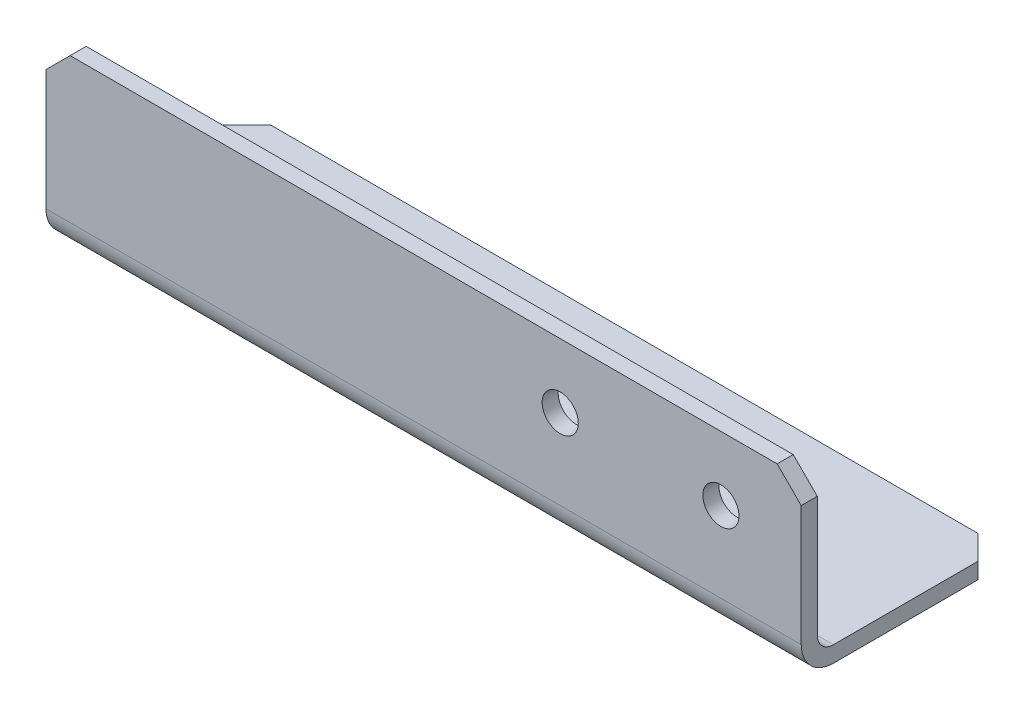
ISO-10303-21;
HEADER;
FILE_DESCRIPTION(('STEP AP214'),'2;1');
FILE_NAME('part.step','',(''),(''),'','','');
FILE_SCHEMA(('AUTOMOTIVE_DESIGN { 1 0 10303 214 1 1 1 1 }'));
ENDSEC;
DATA;
#1=APPLICATION_CONTEXT('core data for automotive mechanical design processes');
#2=APPLICATION_PROTOCOL_DEFINITION('international standard','automotive_design',2000,#1);
#3=PRODUCT_CONTEXT('',#1,'mechanical');
#4=PRODUCT('Part','Part','',(#3));
#5=PRODUCT_RELATED_PRODUCT_CATEGORY('part','',(#4));
#6=PRODUCT_DEFINITION_FORMATION('','',#4);
#7=PRODUCT_DEFINITION_CONTEXT('part definition',#1,'design');
#8=PRODUCT_DEFINITION('design','',#6,#7);
#9=PRODUCT_DEFINITION_SHAPE('','',#8);
#10=(LENGTH_UNIT() NAMED_UNIT(*) SI_UNIT(.MILLI.,.METRE.));
#11=(NAMED_UNIT(*) PLANE_ANGLE_UNIT() SI_UNIT($,.RADIAN.));
#12=(NAMED_UNIT(*) SI_UNIT($,.STERADIAN.) SOLID_ANGLE_UNIT());
#13=UNCERTAINTY_MEASURE_WITH_UNIT(LENGTH_MEASURE(1.E-05),#10,'distance_accuracy_value','');
#14=(GEOMETRIC_REPRESENTATION_CONTEXT(3) GLOBAL_UNCERTAINTY_ASSIGNED_CONTEXT((#13)) GLOBAL_UNIT_ASSIGNED_CONTEXT((#10,
#11,#12)) REPRESENTATION_CONTEXT('',''));
#15=CARTESIAN_POINT('',(0.,0.,0.));
#16=DIRECTION('',(0.,0.,1.));
#17=DIRECTION('',(1.,0.,0.));
#18=AXIS2_PLACEMENT_3D('',#15,#16,#17);
#19=CARTESIAN_POINT('',(93.9999999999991,-1.11022302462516E-13,-24.9999999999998));
#20=DIRECTION('',(0.,0.,1.));
#21=DIRECTION('',(1.,0.,0.));
#22=AXIS2_PLACEMENT_3D('',#19,#20,#21);
#23=PLANE('',#22);
#24=DIRECTION('',(-1.,0.,0.));
#25=VECTOR('',#24,1.);
#26=CARTESIAN_POINT('',(93.9999999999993,2.,-24.9999999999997));
#27=LINE('',#26,#25);
#28=CARTESIAN_POINT('',(90.999999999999,1.99999999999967,-25.));
#29=VERTEX_POINT('',#28);
#30=CARTESIAN_POINT('',(2.99999999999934,2.00000000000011,-25.));
#31=VERTEX_POINT('',#30);
#32=EDGE_CURVE('E145',#29,#31,#27,.T.);
#33=ORIENTED_EDGE('',*,*,#32,.F.);
#34=DIRECTION('',(0.,-1.,0.));
#35=VECTOR('',#34,1.);
#36=CARTESIAN_POINT('',(90.9999999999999,3.33066907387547E-13,-24.9999999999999));
#37=LINE('',#36,#35);
#38=CARTESIAN_POINT('',(90.9999999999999,3.33066907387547E-13,-24.9999999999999));
#39=VERTEX_POINT('',#38);
#40=EDGE_CURVE('E208',#29,#39,#37,.T.);
#41=ORIENTED_EDGE('',*,*,#40,.T.);
#42=DIRECTION('',(-1.,0.,0.));
#43=VECTOR('',#42,1.);
#44=CARTESIAN_POINT('',(93.9999999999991,-1.11022302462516E-13,-24.9999999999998));
#45=LINE('',#44,#43);
#46=CARTESIAN_POINT('',(2.99999999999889,-3.33066907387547E-13,-24.9999999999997));
#47=VERTEX_POINT('',#46);
#48=EDGE_CURVE('E162',#39,#47,#45,.T.);
#49=ORIENTED_EDGE('',*,*,#48,.T.);
#50=DIRECTION('',(0.,1.,0.));
#51=VECTOR('',#50,1.);
#52=CARTESIAN_POINT('',(2.99999999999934,2.00000000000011,-25.));
#53=LINE('',#52,#51);
#54=EDGE_CURVE('E205',#47,#31,#53,.T.);
#55=ORIENTED_EDGE('',*,*,#54,.T.);
#56=EDGE_LOOP('',(#33,#41,#49,#55));
#57=FACE_BOUND('',#56,.T.);
#58=ADVANCED_FACE('F36',(#57),#23,.F.);
#59=CARTESIAN_POINT('',(93.9999999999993,2.,-24.9999999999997));
#60=DIRECTION('',(0.,-1.,0.));
#61=DIRECTION('',(0.,0.,-1.));
#62=AXIS2_PLACEMENT_3D('',#59,#60,#61);
#63=PLANE('',#62);
#64=DIRECTION('',(0.,0.,1.));
#65=VECTOR('',#64,1.);
#66=CARTESIAN_POINT('',(93.9999999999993,2.,-24.9999999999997));
#67=LINE('',#66,#65);
#68=CARTESIAN_POINT('',(93.9999999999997,2.,-21.9999999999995));
#69=VERTEX_POINT('',#68);
#70=CARTESIAN_POINT('',(93.9999999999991,2.00000000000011,-3.99999999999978));
#71=VERTEX_POINT('',#70);
#72=EDGE_CURVE('E125',#69,#71,#67,.T.);
#73=ORIENTED_EDGE('',*,*,#72,.F.);
#74=DIRECTION('',(0.70710678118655,0.,0.707106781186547));
#75=VECTOR('',#74,1.);
#76=CARTESIAN_POINT('',(93.9999999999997,2.,-21.9999999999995));
#77=LINE('',#76,#75);
#78=EDGE_CURVE('E203',#69,#29,#77,.F.);
#79=ORIENTED_EDGE('',*,*,#78,.T.);
#80=ORIENTED_EDGE('',*,*,#32,.T.);
#81=DIRECTION('',(-0.707106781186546,0.,0.707106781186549));
#82=VECTOR('',#81,1.);
#83=CARTESIAN_POINT('',(2.99999999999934,2.00000000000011,-25.));
#84=LINE('',#83,#82);
#85=CARTESIAN_POINT('',(-9.99200722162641E-13,1.99999999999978,-21.9999999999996));
#86=VERTEX_POINT('',#85);
#87=EDGE_CURVE('E201',#31,#86,#84,.T.);
#88=ORIENTED_EDGE('',*,*,#87,.T.);
#89=DIRECTION('',(0.,0.,1.));
#90=VECTOR('',#89,1.);
#91=CARTESIAN_POINT('',(-1.22124532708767E-12,1.99999999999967,-25.));
#92=LINE('',#91,#90);
#93=CARTESIAN_POINT('',(1.11022302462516E-13,2.00000000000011,-4.00000000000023));
#94=VERTEX_POINT('',#93);
#95=EDGE_CURVE('E142',#86,#94,#92,.T.);
#96=ORIENTED_EDGE('',*,*,#95,.T.);
#97=DIRECTION('',(-1.,0.,0.));
#98=VECTOR('',#97,1.);
#99=CARTESIAN_POINT('',(93.9999999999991,2.00000000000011,-3.99999999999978));
#100=LINE('',#99,#98);
#101=EDGE_CURVE('E139',#71,#94,#100,.T.);
#102=ORIENTED_EDGE('',*,*,#101,.F.);
#103=EDGE_LOOP('',(#73,#79,#80,#88,#96,#102));
#104=FACE_BOUND('',#103,.T.);
#105=ADVANCED_FACE('F140',(#104),#63,.F.);
#106=CARTESIAN_POINT('',(93.9999999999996,4.00000000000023,-3.99999999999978));
#107=DIRECTION('',(-1.,0.,0.));
#108=DIRECTION('',(0.,0.,1.));
#109=AXIS2_PLACEMENT_3D('',#106,#107,#108);
#110=CYLINDRICAL_SURFACE('',#109,2.);
#111=CARTESIAN_POINT('',(-1.33226762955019E-12,3.99999999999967,-3.99999999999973));
#112=DIRECTION('',(-1.,0.,0.));
#113=DIRECTION('',(0.,0.,1.));
#114=AXIS2_PLACEMENT_3D('',#111,#112,#113);
#115=CIRCLE('',#114,2.);
#116=CARTESIAN_POINT('',(-9.99200722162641E-13,4.00000000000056,-1.99999999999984));
#117=VERTEX_POINT('',#116);
#118=EDGE_CURVE('E164',#94,#117,#115,.T.);
#119=ORIENTED_EDGE('',*,*,#118,.T.);
#120=DIRECTION('',(-1.,0.,0.));
#121=VECTOR('',#120,1.);
#122=CARTESIAN_POINT('',(93.9999999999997,4.00000000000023,-2.));
#123=LINE('',#122,#121);
#124=CARTESIAN_POINT('',(93.9999999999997,4.00000000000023,-2.));
#125=VERTEX_POINT('',#124);
#126=EDGE_CURVE('E146',#125,#117,#123,.T.);
#127=ORIENTED_EDGE('',*,*,#126,.F.);
#128=CARTESIAN_POINT('',(93.9999999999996,4.00000000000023,-3.99999999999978));
#129=DIRECTION('',(-1.,0.,0.));
#130=DIRECTION('',(0.,0.,1.));
#131=AXIS2_PLACEMENT_3D('',#128,#129,#130);
#132=CIRCLE('',#131,2.);
#133=EDGE_CURVE('E131',#71,#125,#132,.T.);
#134=ORIENTED_EDGE('',*,*,#133,.F.);
#135=ORIENTED_EDGE('',*,*,#101,.T.);
#136=EDGE_LOOP('',(#119,#127,#134,#135));
#137=FACE_BOUND('',#136,.T.);
#138=ADVANCED_FACE('F148',(#137),#110,.F.);
#139=CARTESIAN_POINT('',(93.9999999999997,4.00000000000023,-2.));
#140=DIRECTION('',(0.,0.,1.));
#141=DIRECTION('',(0.,-1.,0.));
#142=AXIS2_PLACEMENT_3D('',#139,#140,#141);
#143=PLANE('',#142);
#144=CARTESIAN_POINT('',(83.9999999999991,14.0000000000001,-1.99999999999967));
#145=DIRECTION('',(0.,0.,-1.));
#146=DIRECTION('',(0.,1.,0.));
#147=AXIS2_PLACEMENT_3D('',#144,#145,#146);
#148=CIRCLE('',#147,2.25);
#149=CARTESIAN_POINT('',(83.9999999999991,16.2500000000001,-1.99999999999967));
#150=VERTEX_POINT('',#149);
#151=EDGE_CURVE('E195',#150,#150,#148,.T.);
#152=ORIENTED_EDGE('',*,*,#151,.F.);
#153=EDGE_LOOP('',(#152));
#154=FACE_BOUND('',#153,.T.);
#155=CARTESIAN_POINT('',(63.9999999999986,14.,-1.99999999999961));
#156=DIRECTION('',(0.,0.,-1.));
#157=DIRECTION('',(0.,1.,0.));
#158=AXIS2_PLACEMENT_3D('',#155,#156,#157);
#159=CIRCLE('',#158,2.25);
#160=CARTESIAN_POINT('',(63.9999999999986,16.25,-1.99999999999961));
#161=VERTEX_POINT('',#160);
#162=EDGE_CURVE('E366',#161,#161,#159,.T.);
#163=ORIENTED_EDGE('',*,*,#162,.F.);
#164=EDGE_LOOP('',(#163));
#165=FACE_BOUND('',#164,.T.);
#166=DIRECTION('',(-1.,0.,0.));
#167=VECTOR('',#166,1.);
#168=CARTESIAN_POINT('',(93.9999999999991,21.9999999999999,-1.99999999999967));
#169=LINE('',#168,#167);
#170=CARTESIAN_POINT('',(90.9999999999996,22.0000000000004,-1.99999999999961));
#171=VERTEX_POINT('',#170);
#172=CARTESIAN_POINT('',(2.99999999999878,22.,-1.99999999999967));
#173=VERTEX_POINT('',#172);
#174=EDGE_CURVE('E186',#171,#173,#169,.T.);
#175=ORIENTED_EDGE('',*,*,#174,.F.);
#176=DIRECTION('',(-0.70710678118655,0.707106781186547,0.));
#177=VECTOR('',#176,1.);
#178=CARTESIAN_POINT('',(94.,19.0000000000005,-2.));
#179=LINE('',#178,#177);
#180=CARTESIAN_POINT('',(94.,19.0000000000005,-2.));
#181=VERTEX_POINT('',#180);
#182=EDGE_CURVE('E11',#171,#181,#179,.F.);
#183=ORIENTED_EDGE('',*,*,#182,.T.);
#184=DIRECTION('',(0.,1.,0.));
#185=VECTOR('',#184,1.);
#186=CARTESIAN_POINT('',(93.9999999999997,4.00000000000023,-2.));
#187=LINE('',#186,#185);
#188=EDGE_CURVE('E151',#125,#181,#187,.T.);
#189=ORIENTED_EDGE('',*,*,#188,.F.);
#190=ORIENTED_EDGE('',*,*,#126,.T.);
#191=DIRECTION('',(0.,1.,0.));
#192=VECTOR('',#191,1.);
#193=CARTESIAN_POINT('',(-9.99200722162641E-13,4.00000000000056,-1.99999999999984));
#194=LINE('',#193,#192);
#195=CARTESIAN_POINT('',(-8.88178419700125E-13,18.9999999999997,-1.99999999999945));
#196=VERTEX_POINT('',#195);
#197=EDGE_CURVE('E167',#117,#196,#194,.T.);
#198=ORIENTED_EDGE('',*,*,#197,.T.);
#199=DIRECTION('',(0.707106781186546,0.70710678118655,0.));
#200=VECTOR('',#199,1.);
#201=CARTESIAN_POINT('',(2.99999999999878,22.,-1.99999999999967));
#202=LINE('',#201,#200);
#203=EDGE_CURVE('E44',#196,#173,#202,.T.);
#204=ORIENTED_EDGE('',*,*,#203,.T.);
#205=EDGE_LOOP('',(#175,#183,#189,#190,#198,#204));
#206=FACE_BOUND('',#205,.T.);
#207=ADVANCED_FACE('F237',(#154,#165,#206),#143,.F.);
#208=CARTESIAN_POINT('',(93.9999999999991,21.9999999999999,-1.99999999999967));
#209=DIRECTION('',(0.,-1.,0.));
#210=DIRECTION('',(0.,0.,-1.));
#211=AXIS2_PLACEMENT_3D('',#208,#209,#210);
#212=PLANE('',#211);
#213=DIRECTION('',(-1.,0.,0.));
#214=VECTOR('',#213,1.);
#215=CARTESIAN_POINT('',(93.999999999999,21.9999999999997,0.));
#216=LINE('',#215,#214);
#217=CARTESIAN_POINT('',(90.9999999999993,22.0000000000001,1.66533453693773E-13));
#218=VERTEX_POINT('',#217);
#219=CARTESIAN_POINT('',(2.99999999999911,22.,3.33066907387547E-13));
#220=VERTEX_POINT('',#219);
#221=EDGE_CURVE('E183',#218,#220,#216,.T.);
#222=ORIENTED_EDGE('',*,*,#221,.F.);
#223=DIRECTION('',(0.,0.,-1.));
#224=VECTOR('',#223,1.);
#225=CARTESIAN_POINT('',(90.9999999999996,22.0000000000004,-1.99999999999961));
#226=LINE('',#225,#224);
#227=EDGE_CURVE('E57',#218,#171,#226,.T.);
#228=ORIENTED_EDGE('',*,*,#227,.T.);
#229=ORIENTED_EDGE('',*,*,#174,.T.);
#230=DIRECTION('',(0.,0.,1.));
#231=VECTOR('',#230,1.);
#232=CARTESIAN_POINT('',(2.99999999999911,22.,3.33066907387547E-13));
#233=LINE('',#232,#231);
#234=EDGE_CURVE('E222',#173,#220,#233,.T.);
#235=ORIENTED_EDGE('',*,*,#234,.T.);
#236=EDGE_LOOP('',(#222,#228,#229,#235));
#237=FACE_BOUND('',#236,.T.);
#238=ADVANCED_FACE('F226',(#237),#212,.F.);
#239=CARTESIAN_POINT('',(93.999999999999,21.9999999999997,0.));
#240=DIRECTION('',(0.,0.,-1.));
#241=DIRECTION('',(0.,1.,0.));
#242=AXIS2_PLACEMENT_3D('',#239,#240,#241);
#243=PLANE('',#242);
#244=CARTESIAN_POINT('',(83.9999999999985,13.9999999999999,4.44089209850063E-13));
#245=DIRECTION('',(0.,0.,-1.));
#246=DIRECTION('',(0.,1.,0.));
#247=AXIS2_PLACEMENT_3D('',#244,#245,#246);
#248=CIRCLE('',#247,2.25);
#249=CARTESIAN_POINT('',(83.9999999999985,16.2499999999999,4.44713710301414E-13));
#250=VERTEX_POINT('',#249);
#251=EDGE_CURVE('E165',#250,#250,#248,.T.);
#252=ORIENTED_EDGE('',*,*,#251,.T.);
#253=EDGE_LOOP('',(#252));
#254=FACE_BOUND('',#253,.T.);
#255=CARTESIAN_POINT('',(63.9999999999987,13.9999999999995,1.11022302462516E-13));
#256=DIRECTION('',(0.,0.,-1.));
#257=DIRECTION('',(0.,1.,0.));
#258=AXIS2_PLACEMENT_3D('',#255,#256,#257);
#259=CIRCLE('',#258,2.25);
#260=CARTESIAN_POINT('',(63.9999999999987,16.2499999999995,1.11646802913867E-13));
#261=VERTEX_POINT('',#260);
#262=EDGE_CURVE('E192',#261,#261,#259,.T.);
#263=ORIENTED_EDGE('',*,*,#262,.T.);
#264=EDGE_LOOP('',(#263));
#265=FACE_BOUND('',#264,.T.);
#266=DIRECTION('',(0.,-1.,0.));
#267=VECTOR('',#266,1.);
#268=CARTESIAN_POINT('',(93.999999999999,21.9999999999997,0.));
#269=LINE('',#268,#267);
#270=CARTESIAN_POINT('',(93.9999999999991,19.,2.22044604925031E-13));
#271=VERTEX_POINT('',#270);
#272=CARTESIAN_POINT('',(94.0000000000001,4.00000000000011,0.));
#273=VERTEX_POINT('',#272);
#274=EDGE_CURVE('E153',#271,#273,#269,.T.);
#275=ORIENTED_EDGE('',*,*,#274,.F.);
#276=DIRECTION('',(0.70710678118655,-0.707106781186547,0.));
#277=VECTOR('',#276,1.);
#278=CARTESIAN_POINT('',(93.9999999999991,19.,2.22044604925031E-13));
#279=LINE('',#278,#277);
#280=EDGE_CURVE('E220',#271,#218,#279,.F.);
#281=ORIENTED_EDGE('',*,*,#280,.T.);
#282=ORIENTED_EDGE('',*,*,#221,.T.);
#283=DIRECTION('',(-0.707106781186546,-0.70710678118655,0.));
#284=VECTOR('',#283,1.);
#285=CARTESIAN_POINT('',(2.99999999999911,22.,3.33066907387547E-13));
#286=LINE('',#285,#284);
#287=CARTESIAN_POINT('',(-7.7715611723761E-13,18.9999999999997,4.44089209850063E-13));
#288=VERTEX_POINT('',#287);
#289=EDGE_CURVE('E218',#220,#288,#286,.T.);
#290=ORIENTED_EDGE('',*,*,#289,.T.);
#291=DIRECTION('',(0.,-1.,0.));
#292=VECTOR('',#291,1.);
#293=CARTESIAN_POINT('',(-1.11022302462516E-13,22.0000000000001,2.77555756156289E-13));
#294=LINE('',#293,#292);
#295=CARTESIAN_POINT('',(-5.55111512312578E-13,3.99999999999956,0.));
#296=VERTEX_POINT('',#295);
#297=EDGE_CURVE('E169',#288,#296,#294,.T.);
#298=ORIENTED_EDGE('',*,*,#297,.T.);
#299=DIRECTION('',(-1.,0.,0.));
#300=VECTOR('',#299,1.);
#301=CARTESIAN_POINT('',(94.0000000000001,4.00000000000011,0.));
#302=LINE('',#301,#300);
#303=EDGE_CURVE('E180',#273,#296,#302,.T.);
#304=ORIENTED_EDGE('',*,*,#303,.F.);
#305=EDGE_LOOP('',(#275,#281,#282,#290,#298,#304));
#306=FACE_BOUND('',#305,.T.);
#307=ADVANCED_FACE('F230',(#254,#265,#306),#243,.F.);
#308=CARTESIAN_POINT('',(93.9999999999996,4.00000000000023,-3.99999999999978));
#309=DIRECTION('',(-1.,0.,0.));
#310=DIRECTION('',(0.,0.,1.));
#311=AXIS2_PLACEMENT_3D('',#308,#309,#310);
#312=CYLINDRICAL_SURFACE('',#311,4.);
#313=CARTESIAN_POINT('',(-1.33226762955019E-12,3.99999999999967,-3.99999999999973));
#314=DIRECTION('',(1.,0.,0.));
#315=DIRECTION('',(0.,0.,1.));
#316=AXIS2_PLACEMENT_3D('',#313,#314,#315);
#317=CIRCLE('',#316,4.);
#318=CARTESIAN_POINT('',(-1.11022302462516E-13,-1.11022302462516E-13,-3.99999999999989));
#319=VERTEX_POINT('',#318);
#320=EDGE_CURVE('E171',#296,#319,#317,.T.);
#321=ORIENTED_EDGE('',*,*,#320,.T.);
#322=DIRECTION('',(-1.,0.,0.));
#323=VECTOR('',#322,1.);
#324=CARTESIAN_POINT('',(93.9999999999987,-1.11022302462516E-13,-3.99999999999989));
#325=LINE('',#324,#323);
#326=CARTESIAN_POINT('',(93.9999999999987,-1.11022302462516E-13,-3.99999999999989));
#327=VERTEX_POINT('',#326);
#328=EDGE_CURVE('E177',#327,#319,#325,.T.);
#329=ORIENTED_EDGE('',*,*,#328,.F.);
#330=CARTESIAN_POINT('',(93.9999999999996,4.00000000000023,-3.99999999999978));
#331=DIRECTION('',(1.,0.,0.));
#332=DIRECTION('',(0.,0.,1.));
#333=AXIS2_PLACEMENT_3D('',#330,#331,#332);
#334=CIRCLE('',#333,4.);
#335=EDGE_CURVE('E158',#273,#327,#334,.T.);
#336=ORIENTED_EDGE('',*,*,#335,.F.);
#337=ORIENTED_EDGE('',*,*,#303,.T.);
#338=EDGE_LOOP('',(#321,#329,#336,#337));
#339=FACE_BOUND('',#338,.T.);
#340=ADVANCED_FACE('F280',(#339),#312,.T.);
#341=CARTESIAN_POINT('',(93.9999999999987,-1.11022302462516E-13,-3.99999999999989));
#342=DIRECTION('',(0.,1.,0.));
#343=DIRECTION('',(0.,0.,1.));
#344=AXIS2_PLACEMENT_3D('',#341,#342,#343);
#345=PLANE('',#344);
#346=ORIENTED_EDGE('',*,*,#48,.F.);
#347=DIRECTION('',(-0.70710678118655,0.,-0.707106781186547));
#348=VECTOR('',#347,1.);
#349=CARTESIAN_POINT('',(93.9999999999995,0.,-21.9999999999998));
#350=LINE('',#349,#348);
#351=CARTESIAN_POINT('',(93.9999999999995,0.,-21.9999999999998));
#352=VERTEX_POINT('',#351);
#353=EDGE_CURVE('E212',#39,#352,#350,.F.);
#354=ORIENTED_EDGE('',*,*,#353,.T.);
#355=DIRECTION('',(0.,0.,-1.));
#356=VECTOR('',#355,1.);
#357=CARTESIAN_POINT('',(93.9999999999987,-1.11022302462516E-13,-3.99999999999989));
#358=LINE('',#357,#356);
#359=EDGE_CURVE('E160',#327,#352,#358,.T.);
#360=ORIENTED_EDGE('',*,*,#359,.F.);
#361=ORIENTED_EDGE('',*,*,#328,.T.);
#362=DIRECTION('',(0.,0.,-1.));
#363=VECTOR('',#362,1.);
#364=CARTESIAN_POINT('',(-1.11022302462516E-13,-1.11022302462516E-13,-3.99999999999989));
#365=LINE('',#364,#363);
#366=CARTESIAN_POINT('',(-1.55431223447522E-12,-8.88178419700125E-13,-21.9999999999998));
#367=VERTEX_POINT('',#366);
#368=EDGE_CURVE('E136',#319,#367,#365,.T.);
#369=ORIENTED_EDGE('',*,*,#368,.T.);
#370=DIRECTION('',(0.707106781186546,0.,-0.707106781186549));
#371=VECTOR('',#370,1.);
#372=CARTESIAN_POINT('',(2.99999999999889,-3.33066907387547E-13,-24.9999999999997));
#373=LINE('',#372,#371);
#374=EDGE_CURVE('E210',#367,#47,#373,.T.);
#375=ORIENTED_EDGE('',*,*,#374,.T.);
#376=EDGE_LOOP('',(#346,#354,#360,#361,#369,#375));
#377=FACE_BOUND('',#376,.T.);
#378=ADVANCED_FACE('F272',(#377),#345,.F.);
#379=CARTESIAN_POINT('',(93.9999999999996,4.00000000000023,-3.99999999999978));
#380=DIRECTION('',(-1.,0.,0.));
#381=DIRECTION('',(0.,0.,1.));
#382=AXIS2_PLACEMENT_3D('',#379,#380,#381);
#383=PLANE('',#382);
#384=ORIENTED_EDGE('',*,*,#359,.T.);
#385=DIRECTION('',(0.,1.,0.));
#386=VECTOR('',#385,1.);
#387=CARTESIAN_POINT('',(93.9999999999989,4.00000000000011,-21.9999999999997));
#388=LINE('',#387,#386);
#389=EDGE_CURVE('E134',#352,#69,#388,.T.);
#390=ORIENTED_EDGE('',*,*,#389,.T.);
#391=ORIENTED_EDGE('',*,*,#72,.T.);
#392=ORIENTED_EDGE('',*,*,#133,.T.);
#393=ORIENTED_EDGE('',*,*,#188,.T.);
#394=DIRECTION('',(0.,0.,1.));
#395=VECTOR('',#394,1.);
#396=CARTESIAN_POINT('',(93.9999999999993,19.,-3.99999999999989));
#397=LINE('',#396,#395);
#398=EDGE_CURVE('E191',#181,#271,#397,.T.);
#399=ORIENTED_EDGE('',*,*,#398,.T.);
#400=ORIENTED_EDGE('',*,*,#274,.T.);
#401=ORIENTED_EDGE('',*,*,#335,.T.);
#402=EDGE_LOOP('',(#384,#390,#391,#392,#393,#399,#400,#401));
#403=FACE_BOUND('',#402,.T.);
#404=ADVANCED_FACE('F128',(#403),#383,.F.);
#405=CARTESIAN_POINT('',(-1.33226762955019E-12,3.99999999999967,-3.99999999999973));
#406=DIRECTION('',(-1.,0.,0.));
#407=DIRECTION('',(0.,0.,1.));
#408=AXIS2_PLACEMENT_3D('',#405,#406,#407);
#409=PLANE('',#408);
#410=ORIENTED_EDGE('',*,*,#95,.F.);
#411=DIRECTION('',(0.,-1.,0.));
#412=VECTOR('',#411,1.);
#413=CARTESIAN_POINT('',(-1.55431223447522E-12,-8.88178419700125E-13,-21.9999999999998));
#414=LINE('',#413,#412);
#415=EDGE_CURVE('E216',#86,#367,#414,.T.);
#416=ORIENTED_EDGE('',*,*,#415,.T.);
#417=ORIENTED_EDGE('',*,*,#368,.F.);
#418=ORIENTED_EDGE('',*,*,#320,.F.);
#419=ORIENTED_EDGE('',*,*,#297,.F.);
#420=DIRECTION('',(0.,0.,-1.));
#421=VECTOR('',#420,1.);
#422=CARTESIAN_POINT('',(-8.88178419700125E-13,18.9999999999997,-1.99999999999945));
#423=LINE('',#422,#421);
#424=EDGE_CURVE('E214',#288,#196,#423,.T.);
#425=ORIENTED_EDGE('',*,*,#424,.T.);
#426=ORIENTED_EDGE('',*,*,#197,.F.);
#427=ORIENTED_EDGE('',*,*,#118,.F.);
#428=EDGE_LOOP('',(#410,#416,#417,#418,#419,#425,#426,#427));
#429=FACE_BOUND('',#428,.T.);
#430=ADVANCED_FACE('F240',(#429),#409,.T.);
#431=CARTESIAN_POINT('',(63.9999999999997,14.0000000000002,8.00000000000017));
#432=DIRECTION('',(0.,0.,-1.));
#433=DIRECTION('',(0.,1.,0.));
#434=AXIS2_PLACEMENT_3D('',#431,#432,#433);
#435=CYLINDRICAL_SURFACE('',#434,2.25);
#436=ORIENTED_EDGE('',*,*,#162,.T.);
#437=EDGE_LOOP('',(#436));
#438=FACE_BOUND('',#437,.T.);
#439=ORIENTED_EDGE('',*,*,#262,.F.);
#440=EDGE_LOOP('',(#439));
#441=FACE_BOUND('',#440,.T.);
#442=ADVANCED_FACE('F332',(#438,#441),#435,.F.);
#443=CARTESIAN_POINT('',(83.9999999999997,14.,8.00000000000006));
#444=DIRECTION('',(0.,0.,-1.));
#445=DIRECTION('',(0.,1.,0.));
#446=AXIS2_PLACEMENT_3D('',#443,#444,#445);
#447=CYLINDRICAL_SURFACE('',#446,2.25);
#448=ORIENTED_EDGE('',*,*,#151,.T.);
#449=EDGE_LOOP('',(#448));
#450=FACE_BOUND('',#449,.T.);
#451=ORIENTED_EDGE('',*,*,#251,.F.);
#452=EDGE_LOOP('',(#451));
#453=FACE_BOUND('',#452,.T.);
#454=ADVANCED_FACE('F261',(#450,#453),#447,.F.);
#455=CARTESIAN_POINT('',(93.9999999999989,4.00000000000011,-21.9999999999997));
#456=DIRECTION('',(-0.707106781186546,0.,0.707106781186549));
#457=DIRECTION('',(0.,1.,0.));
#458=AXIS2_PLACEMENT_3D('',#455,#456,#457);
#459=PLANE('',#458);
#460=ORIENTED_EDGE('',*,*,#353,.F.);
#461=ORIENTED_EDGE('',*,*,#40,.F.);
#462=ORIENTED_EDGE('',*,*,#78,.F.);
#463=ORIENTED_EDGE('',*,*,#389,.F.);
#464=EDGE_LOOP('',(#460,#461,#462,#463));
#465=FACE_BOUND('',#464,.T.);
#466=ADVANCED_FACE('F258',(#465),#459,.F.);
#467=CARTESIAN_POINT('',(2.99999999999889,-3.33066907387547E-13,-24.9999999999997));
#468=DIRECTION('',(-0.70710678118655,0.,-0.707106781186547));
#469=DIRECTION('',(0.,-1.,0.));
#470=AXIS2_PLACEMENT_3D('',#467,#468,#469);
#471=PLANE('',#470);
#472=ORIENTED_EDGE('',*,*,#374,.F.);
#473=ORIENTED_EDGE('',*,*,#415,.F.);
#474=ORIENTED_EDGE('',*,*,#87,.F.);
#475=ORIENTED_EDGE('',*,*,#54,.F.);
#476=EDGE_LOOP('',(#472,#473,#474,#475));
#477=FACE_BOUND('',#476,.T.);
#478=ADVANCED_FACE('F247',(#477),#471,.T.);
#479=CARTESIAN_POINT('',(93.9999999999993,19.,-3.99999999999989));
#480=DIRECTION('',(-0.707106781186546,-0.707106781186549,0.));
#481=DIRECTION('',(0.,0.,1.));
#482=AXIS2_PLACEMENT_3D('',#479,#480,#481);
#483=PLANE('',#482);
#484=ORIENTED_EDGE('',*,*,#182,.F.);
#485=ORIENTED_EDGE('',*,*,#227,.F.);
#486=ORIENTED_EDGE('',*,*,#280,.F.);
#487=ORIENTED_EDGE('',*,*,#398,.F.);
#488=EDGE_LOOP('',(#484,#485,#486,#487));
#489=FACE_BOUND('',#488,.T.);
#490=ADVANCED_FACE('F236',(#489),#483,.F.);
#491=CARTESIAN_POINT('',(2.99999999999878,22.,-1.99999999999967));
#492=DIRECTION('',(-0.70710678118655,0.707106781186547,0.));
#493=DIRECTION('',(0.,0.,-1.));
#494=AXIS2_PLACEMENT_3D('',#491,#492,#493);
#495=PLANE('',#494);
#496=ORIENTED_EDGE('',*,*,#203,.F.);
#497=ORIENTED_EDGE('',*,*,#424,.F.);
#498=ORIENTED_EDGE('',*,*,#289,.F.);
#499=ORIENTED_EDGE('',*,*,#234,.F.);
#500=EDGE_LOOP('',(#496,#497,#498,#499));
#501=FACE_BOUND('',#500,.T.);
#502=ADVANCED_FACE('F38',(#501),#495,.T.);
#503=CLOSED_SHELL('',(#58,#105,#138,#207,#238,#307,#340,#378,#404,#430,#442,#454,#466,#478,#490,#502));
#504=MANIFOLD_SOLID_BREP('B2',#503);
#505=ADVANCED_BREP_SHAPE_REPRESENTATION('',(#18,#504),#14);
#506=SHAPE_DEFINITION_REPRESENTATION(#9,#505);
ENDSEC;
END-ISO-10303-21;
